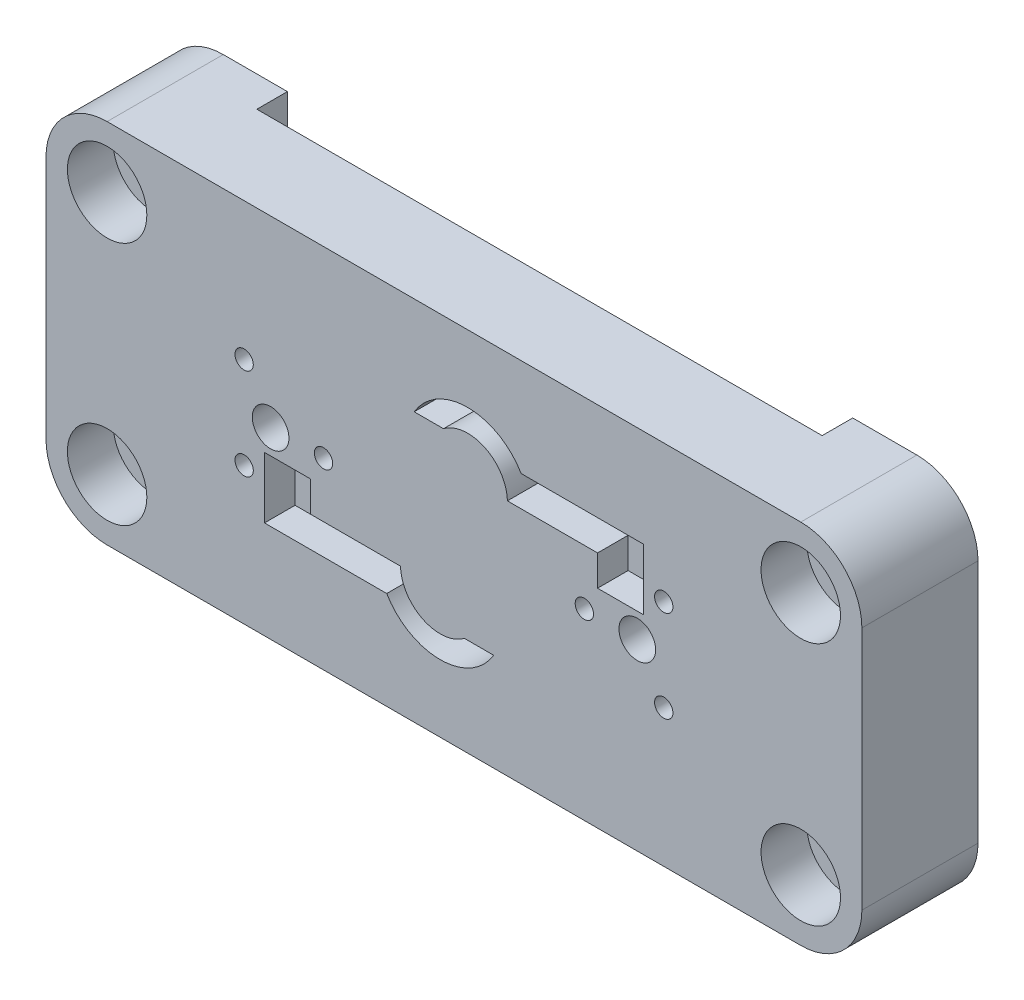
from build123d import *

# Parameters (mm, degrees)
EXTRUSION1_DEPTH                                  = 3.8
CHAMBRAGE_POUR_VIS_T_TE_HEXAGONALE_M1_D           = 1.5
CHAMBRAGE_POUR_VIS_T_TE_HEXAGONALE_M1_CBORE_D     = 2.6
CHAMBRAGE_POUR_VIS_T_TE_HEXAGONALE_M1_CBORE_DEPTH = 1.5
ENL_V_MAT_EXTRU_1_DEPTH                           = 1
ESQUISSE4_R                                       = 2.4
ESQUISSE4_R_2                                     = 2.1
EXTRUSION3_DEPTH                                  = 0.2
ESQUISSE5_R                                       = 0.6
ESQUISSE5_R_2                                     = 0.3
ENL_V_MAT_EXTRU_2_DEPTH                           = 15.901761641
ENL_V_MAT_EXTRU_3_DEPTH                           = 1
R_P_TITION_CIRCULAIRE1_COUNT                      = 2


with BuildPart() as part:
    # Esquisse1 → Extrusion1 (new body)
    with BuildSketch(Plane.XY):
        with BuildLine():
            Line((-11.35, 6), (11.35, 6))
            ThreePointArc((11.35, 6), (12.764213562, 5.414213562), (13.35, 4))
            Line((13.35, 4), (13.35, -4))
            ThreePointArc((13.35, -4), (12.764213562, -5.414213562), (11.35, -6))
            Line((11.35, -6), (-11.35, -6))
            ThreePointArc((-11.35, -6), (-12.764213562, -5.414213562), (-13.35, -4))
            Line((-13.35, -4), (-13.35, 4))
            ThreePointArc((-13.35, 4), (-12.764213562, 5.414213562), (-11.35, 6))
        make_face()
    extrude(amount=EXTRUSION1_DEPTH)

    # Chambrage pour vis _ t_te hexagonale M1 (through all)
    with Locations(Plane(origin=(-11.35, 4, 3.8), x_dir=(1, 0, 0), z_dir=(0, 0, 1))):
        with Locations((0, 0), (22.7, -8), (22.7, 0), (0, -8)):
            CounterBoreHole(CHAMBRAGE_POUR_VIS_T_TE_HEXAGONALE_M1_D / 2, CHAMBRAGE_POUR_VIS_T_TE_HEXAGONALE_M1_CBORE_D / 2, CHAMBRAGE_POUR_VIS_T_TE_HEXAGONALE_M1_CBORE_DEPTH)

    # Esquisse3 → Enl_v. mat.-Extru.1 (cut)
    with BuildSketch(Plane(origin=(0, 0, 0), x_dir=(-1, 0, 0), z_dir=(0, 0, -1))):
        with BuildLine():
            Line((-9.25, 6), (9.25, 6))
            Line((9.25, 6), (9.25, 3.9))
            ThreePointArc((9.25, 3.9), (9.835786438, 2.485786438), (11.25, 1.9))
            Line((11.25, 1.9), (11.5, 1.9))
            Line((11.5, 1.9), (11.5, -1.9))
            Line((11.5, -1.9), (11.25, -1.9))
            ThreePointArc((11.25, -1.9), (9.835786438, -2.485786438), (9.25, -3.9))
            Line((9.25, -3.9), (9.25, -6))
            Line((9.25, -6), (-9.25, -6))
            Line((-9.25, -6), (-9.25, -3.9))
            ThreePointArc((-9.25, -3.9), (-9.835786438, -2.485786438), (-11.25, -1.9))
            Line((-11.25, -1.9), (-11.5, -1.9))
            Line((-11.5, -1.9), (-11.5, 1.9))
            Line((-11.5, 1.9), (-11.25, 1.9))
            ThreePointArc((-11.25, 1.9), (-9.835786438, 2.485786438), (-9.25, 3.9))
            Line((-9.25, 3.9), (-9.25, 6))
        make_face()
    extrude(amount=-ENL_V_MAT_EXTRU_1_DEPTH, mode=Mode.SUBTRACT)

    # Esquisse4 → Extrusion3 (add)
    # profile 1 of 2: a face of its own
    with BuildSketch(Plane(origin=(0, 0, 1), x_dir=(-1, 0, 0), z_dir=(0, 0, -1))):
        with Locations(Location((6, 0, 0), (0, 0, 180))):
            Circle(ESQUISSE4_R)
        with Locations((6, 0)):
            Circle(ESQUISSE4_R_2, mode=Mode.SUBTRACT)
    # profile 2 of 2: a face of its own
    with BuildSketch(Plane(origin=(0, 0, 1), x_dir=(-1, 0, 0), z_dir=(0, 0, -1))):
        with Locations(Location((-6, 0, 0), (0, 0, 180))):
            Circle(ESQUISSE4_R)
        with Locations(Location((-6, 0, 0), (0, 0, 180))):
            Circle(ESQUISSE4_R_2, mode=Mode.SUBTRACT)
    extrude(amount=EXTRUSION3_DEPTH)

    # Esquisse5 → Enl_v. mat.-Extru.2 (cut, through all)
    with BuildSketch(Plane(origin=(0, 0, 1), x_dir=(-1, 0, 0), z_dir=(0, 0, -1))):
        with Locations((-6, 0)):
            Circle(ESQUISSE5_R)
        with Locations((-4.267949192, 0)):
            Circle(ESQUISSE5_R_2)
        with Locations((-6.866025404, 1.5)):
            Circle(ESQUISSE5_R_2)
        with Locations((-6.866025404, -1.5)):
            Circle(ESQUISSE5_R_2)
        with Locations(Location((4.267949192, 0, 0), (0, 0, 180))):
            Circle(ESQUISSE5_R_2)
        with Locations(Location((6.866025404, -1.5, 0), (0, 0, 180))):
            Circle(ESQUISSE5_R_2)
        with Locations(Location((6, 0, 0), (0, 0, 180))):
            Circle(ESQUISSE5_R)
        with Locations(Location((6.866025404, 1.5, 0), (0, 0, 180))):
            Circle(ESQUISSE5_R_2)
    extrude(amount=-ENL_V_MAT_EXTRU_2_DEPTH, mode=Mode.SUBTRACT)

    # Esquisse6 → Enl_v. mat.-Extru.3 (cut)
    with BuildSketch(Plane.XY.offset(3.8)):
        with BuildLine():
            Line((-6.2, -0.8), (-6.2, -2.8))
            Line((-6.2, -2.8), (-2.2, -2.8))
            ThreePointArc((-2.2, -2.8), (-0.45, -3.8), (1.3, -2.8))
            Line((1.3, -2.8), (0.341532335, -2.8))
            ThreePointArc((0.341532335, -2.8), (-1.010838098, -2.941550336), (-1.749624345, -1.8))
            Line((-1.749624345, -1.8), (-4.7, -1.8))
            Line((-4.7, -1.8), (-4.7, -0.8))
            Line((-4.7, -0.8), (-6.2, -0.8))
        make_face()
    enl_v_mat_extru_3 = extrude(amount=-ENL_V_MAT_EXTRU_3_DEPTH, mode=Mode.SUBTRACT)

    # R_p_tition circulaire1: Enl_v. mat.-Extru.3 ×2 about axis
    r_p_tition_circulaire1_axis = Axis((0, 0, 0), (0, 0, 1))
    for i in range(1, R_P_TITION_CIRCULAIRE1_COUNT):
        add(enl_v_mat_extru_3.rotate(r_p_tition_circulaire1_axis, i * 360 / R_P_TITION_CIRCULAIRE1_COUNT), mode=Mode.SUBTRACT)


solid = part.part
